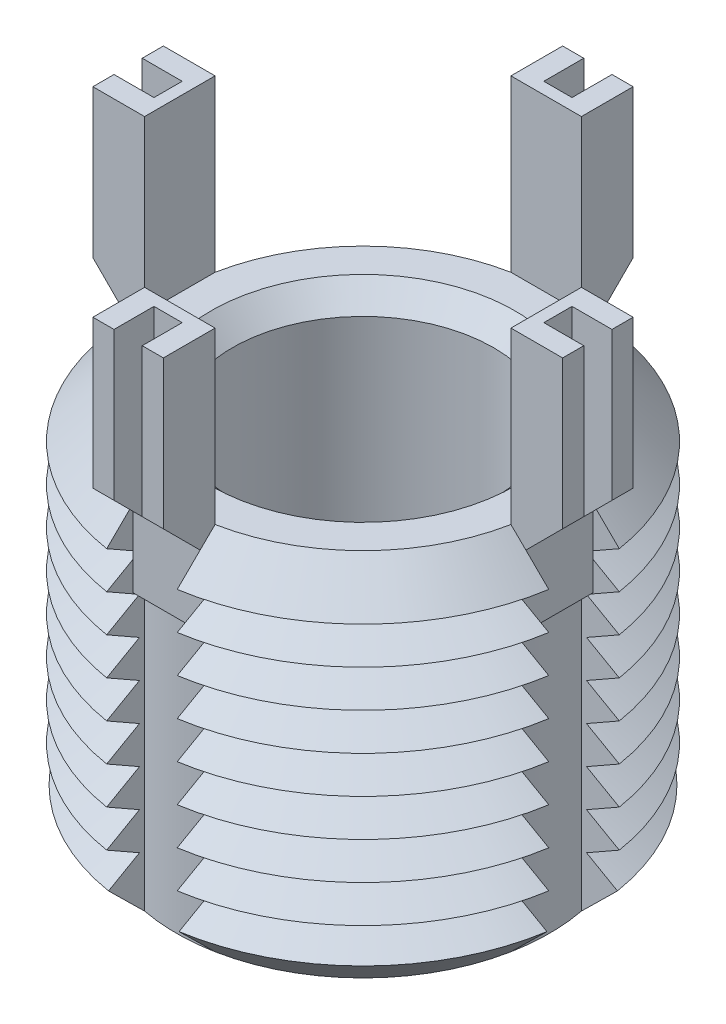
from build123d import *

# Parameters (mm, degrees)
SKETCH1_R               = 9.525
BOSS_EXTRUDE1_DEPTH     = 15.748
CHAMFER1_SIZE           = 1.587
LPATTERN1_COUNT         = 8
LPATTERN1_PITCH         = 1.587
CUT_EXTRUDE1_REACH      = 22.723
CIRPATTERN1_COUNT       = 4
BOSS_EXTRUDE3_DEPTH     = 1.5
CIRPATTERN2_COUNT       = 4
CUT_EXTRUDE3_DEPTH      = 27.985213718
CUT_EXTRUDE3_DEPTH_BACK = 27.985213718
SKETCH6_W               = 1.7
SKETCH6_H               = 1.2
SKETCH6_W_2             = 1.2
SKETCH6_H_2             = 1.7
SKETCH7_R               = 5.556
CUT_EXTRUDE4_DEPTH      = 15.748
CHAMFER2_SIZE           = 0.907


with BuildPart() as part:
    # Sketch1 → Boss-Extrude1 (new body)
    with BuildSketch(Plane(origin=(0, 0, 0), x_dir=(1, 0, 0), z_dir=(0, 1, 0))):
        with Locations(Location((0, 0, 0), (0, 0, 270))):
            Circle(SKETCH1_R)
    extrude(amount=-BOSS_EXTRUDE1_DEPTH)

    # Chamfer1
    chamfer1_edges = [part.edges().sort_by_distance(p)[0] for p in [
        (0, 0, -9.525),
        (0, -15.748, -9.525),
    ]]
    chamfer(chamfer1_edges, length=CHAMFER1_SIZE)

    # Sketch3 → Cut-Revolve1 (revolve, cut)
    with BuildSketch(Plane(origin=(0, 0, 0), x_dir=(0, 0, -1), z_dir=(1, 0, 0))):
        Polygon((-9.525, -1.587), (-8.150617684, -2.3805), (-9.525, -3.174), align=None)
    cut_revolve1 = revolve(axis=Axis((0, 0.885892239, 0), (0, -1, 0)), mode=Mode.SUBTRACT)

    # LPattern1: Cut-Revolve1 ×8
    with Locations(*[(0, -i * LPATTERN1_PITCH, 0) for i in range(1, LPATTERN1_COUNT)]):
        add(cut_revolve1, mode=Mode.SUBTRACT)

    # Cut-Extrude1: up to this cone (the profile starts inside it)
    cut_extrude1_end = Plane(origin=(0, 0, 0), z_dir=(0, 1, 0)).offset(-23.685999) * Cone(1e-06, 70.595, 70.594999, align=(Align.CENTER, Align.CENTER, Align.MIN), mode=Mode.PRIVATE)
    # Sketch4 → Cut-Extrude1 (cut, up to the surface)
    with BuildSketch(Plane(origin=(0, 0, 0), x_dir=(1, 0, 0), z_dir=(0, 1, 0)), mode=Mode.PRIVATE) as cut_extrude1_sk1:
        with BuildLine():
            Line((-7.79498839, 1.5), (-9.406148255, 1.5))
            ThreePointArc((-9.406148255, 1.5), (-9.525, 0), (-9.406148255, -1.5))
            Line((-9.406148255, -1.5), (-7.79498839, -1.5))
            ThreePointArc((-7.79498839, -1.5), (-7.938, 0), (-7.79498839, 1.5))
        make_face()
    cut_extrude1_tool1 = extrude(cut_extrude1_sk1.sketch, amount=-CUT_EXTRUDE1_REACH, mode=Mode.PRIVATE) & cut_extrude1_end
    cut_extrude1 = cut_extrude1_tool1.solids().sort_by_distance((-8.687817, 0, 0))[0]
    add(cut_extrude1, mode=Mode.SUBTRACT)

    # CirPattern1: Cut-Extrude1 ×4 about axis
    cirpattern1_axis = Axis((0, 0, 0), (0, 1, 0))
    for i in range(1, CIRPATTERN1_COUNT):
        add(cut_extrude1.rotate(cirpattern1_axis, i * 360 / CIRPATTERN1_COUNT), mode=Mode.SUBTRACT)

    # Sketch5 → Boss-Extrude3 (add, symmetric)
    with BuildSketch(Plane(origin=(0, 0, 0), x_dir=(0, 0, -1), z_dir=(1, 0, 0))):
        Polygon((-7.79498839, 7.239), (-7.79498839, -3.761), (-8.29498839, -3.761), (-8.29498839, -0.761), (-9.99498839, 0.939), (-9.99498839, 7.239), align=None)
    boss_extrude3 = extrude(amount=BOSS_EXTRUDE3_DEPTH, both=True)

    # CirPattern2: Boss-Extrude3 ×4 about axis
    cirpattern2_axis = Axis((0, 0, 0), (0, 1, 0))
    for i in range(1, CIRPATTERN2_COUNT):
        add(boss_extrude3.rotate(cirpattern2_axis, i * 360 / CIRPATTERN2_COUNT))

    # Sketch6 → Cut-Extrude3 (cut, two sides: drawn at the far end of the back side and taken through both)
    with BuildSketch(Plane(origin=(0, 7.239, 0), x_dir=(1, 0, 0), z_dir=(0, 1, 0)).offset(-CUT_EXTRUDE3_DEPTH_BACK)):
        with Locations((-9.14498839, 0)):
            Rectangle(SKETCH6_W, SKETCH6_H)
        with Locations((0, 9.14498839)):
            Rectangle(SKETCH6_W_2, SKETCH6_H_2)
        with Locations((9.14498839, 0)):
            Rectangle(SKETCH6_W, SKETCH6_H)
        with Locations((0, -9.14498839)):
            Rectangle(SKETCH6_W_2, SKETCH6_H_2)
    extrude(amount=CUT_EXTRUDE3_DEPTH + CUT_EXTRUDE3_DEPTH_BACK, mode=Mode.SUBTRACT)

    # Sketch7 → Cut-Extrude4 (cut)
    with BuildSketch(Plane(origin=(0, 0, 0), x_dir=(1, 0, 0), z_dir=(0, 1, 0))):
        with Locations(Location((0, 0, 0), (0, 0, 270))):
            Circle(SKETCH7_R)
    extrude(amount=-CUT_EXTRUDE4_DEPTH, mode=Mode.SUBTRACT)

    # Chamfer2
    chamfer2_edges = [part.edges().sort_by_distance(p)[0] for p in [
        (0, 0, -5.556),
        (0, -15.748, -5.556),
    ]]
    chamfer(chamfer2_edges, length=CHAMFER2_SIZE)


solid = part.part
